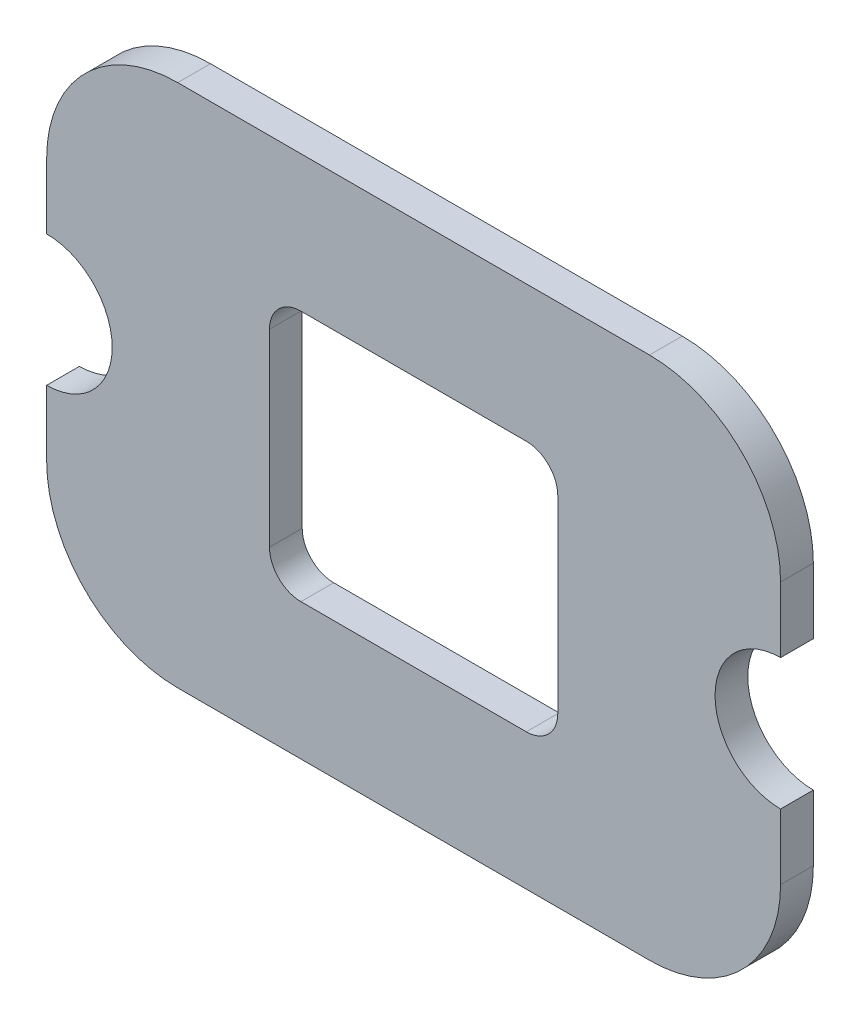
ISO-10303-21;
HEADER;
FILE_DESCRIPTION(('STEP AP214'),'2;1');
FILE_NAME('part.step','',(''),(''),'','','');
FILE_SCHEMA(('AUTOMOTIVE_DESIGN { 1 0 10303 214 1 1 1 1 }'));
ENDSEC;
DATA;
#1=APPLICATION_CONTEXT('core data for automotive mechanical design processes');
#2=APPLICATION_PROTOCOL_DEFINITION('international standard','automotive_design',2000,#1);
#3=PRODUCT_CONTEXT('',#1,'mechanical');
#4=PRODUCT('Part','Part','',(#3));
#5=PRODUCT_RELATED_PRODUCT_CATEGORY('part','',(#4));
#6=PRODUCT_DEFINITION_FORMATION('','',#4);
#7=PRODUCT_DEFINITION_CONTEXT('part definition',#1,'design');
#8=PRODUCT_DEFINITION('design','',#6,#7);
#9=PRODUCT_DEFINITION_SHAPE('','',#8);
#10=(LENGTH_UNIT() NAMED_UNIT(*) SI_UNIT(.MILLI.,.METRE.));
#11=(NAMED_UNIT(*) PLANE_ANGLE_UNIT() SI_UNIT($,.RADIAN.));
#12=(NAMED_UNIT(*) SI_UNIT($,.STERADIAN.) SOLID_ANGLE_UNIT());
#13=UNCERTAINTY_MEASURE_WITH_UNIT(LENGTH_MEASURE(1.E-05),#10,'distance_accuracy_value','');
#14=(GEOMETRIC_REPRESENTATION_CONTEXT(3) GLOBAL_UNCERTAINTY_ASSIGNED_CONTEXT((#13)) GLOBAL_UNIT_ASSIGNED_CONTEXT((#10,
#11,#12)) REPRESENTATION_CONTEXT('',''));
#15=CARTESIAN_POINT('',(0.,0.,0.));
#16=DIRECTION('',(0.,0.,1.));
#17=DIRECTION('',(1.,0.,0.));
#18=AXIS2_PLACEMENT_3D('',#15,#16,#17);
#19=CARTESIAN_POINT('',(-11.43,6.35,1.5875));
#20=DIRECTION('',(0.,0.,1.));
#21=DIRECTION('',(1.,0.,0.));
#22=AXIS2_PLACEMENT_3D('',#19,#20,#21);
#23=PLANE('',#22);
#24=CARTESIAN_POINT('',(-11.43,-6.35,1.5875));
#25=DIRECTION('',(0.,0.,-1.));
#26=DIRECTION('',(-1.,0.,0.));
#27=AXIS2_PLACEMENT_3D('',#24,#25,#26);
#28=CIRCLE('',#27,6.35);
#29=CARTESIAN_POINT('',(-11.43,-12.7,1.5875));
#30=VERTEX_POINT('',#29);
#31=CARTESIAN_POINT('',(-17.78,-6.35,1.5875));
#32=VERTEX_POINT('',#31);
#33=EDGE_CURVE('E266',#30,#32,#28,.T.);
#34=ORIENTED_EDGE('',*,*,#33,.F.);
#35=DIRECTION('',(1.,0.,0.));
#36=VECTOR('',#35,1.);
#37=CARTESIAN_POINT('',(-11.4299999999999,-12.7,1.5875));
#38=LINE('',#37,#36);
#39=CARTESIAN_POINT('',(11.43,-12.7,1.5875));
#40=VERTEX_POINT('',#39);
#41=EDGE_CURVE('E200',#30,#40,#38,.T.);
#42=ORIENTED_EDGE('',*,*,#41,.T.);
#43=CARTESIAN_POINT('',(11.43,-6.35,1.5875));
#44=DIRECTION('',(0.,0.,-1.));
#45=DIRECTION('',(-1.,0.,0.));
#46=AXIS2_PLACEMENT_3D('',#43,#44,#45);
#47=CIRCLE('',#46,6.35);
#48=CARTESIAN_POINT('',(17.78,-6.34999999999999,1.5875));
#49=VERTEX_POINT('',#48);
#50=EDGE_CURVE('E203',#49,#40,#47,.T.);
#51=ORIENTED_EDGE('',*,*,#50,.F.);
#52=DIRECTION('',(0.,-1.,0.));
#53=VECTOR('',#52,1.);
#54=CARTESIAN_POINT('',(17.78,6.34999999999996,1.5875));
#55=LINE('',#54,#53);
#56=CARTESIAN_POINT('',(17.78,-3.175,1.5875));
#57=VERTEX_POINT('',#56);
#58=EDGE_CURVE('E197',#49,#57,#55,.F.);
#59=ORIENTED_EDGE('',*,*,#58,.T.);
#60=CARTESIAN_POINT('',(17.78,0.,1.5875));
#61=DIRECTION('',(0.,0.,1.));
#62=DIRECTION('',(1.,0.,0.));
#63=AXIS2_PLACEMENT_3D('',#60,#61,#62);
#64=CIRCLE('',#63,3.175);
#65=CARTESIAN_POINT('',(17.78,3.175,1.5875));
#66=VERTEX_POINT('',#65);
#67=EDGE_CURVE('E164',#57,#66,#64,.F.);
#68=ORIENTED_EDGE('',*,*,#67,.T.);
#69=DIRECTION('',(0.,-1.,0.));
#70=VECTOR('',#69,1.);
#71=CARTESIAN_POINT('',(17.78,6.34999999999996,1.5875));
#72=LINE('',#71,#70);
#73=CARTESIAN_POINT('',(17.78,6.34999999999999,1.5875));
#74=VERTEX_POINT('',#73);
#75=EDGE_CURVE('E160',#66,#74,#72,.F.);
#76=ORIENTED_EDGE('',*,*,#75,.T.);
#77=CARTESIAN_POINT('',(11.43,6.35,1.5875));
#78=DIRECTION('',(0.,0.,-1.));
#79=DIRECTION('',(-1.,0.,0.));
#80=AXIS2_PLACEMENT_3D('',#77,#78,#79);
#81=CIRCLE('',#80,6.35);
#82=CARTESIAN_POINT('',(11.43,12.7,1.5875));
#83=VERTEX_POINT('',#82);
#84=EDGE_CURVE('E20',#83,#74,#81,.T.);
#85=ORIENTED_EDGE('',*,*,#84,.F.);
#86=DIRECTION('',(1.,0.,0.));
#87=VECTOR('',#86,1.);
#88=CARTESIAN_POINT('',(-11.43,12.7,1.5875));
#89=LINE('',#88,#87);
#90=CARTESIAN_POINT('',(-11.43,12.7,1.5875));
#91=VERTEX_POINT('',#90);
#92=EDGE_CURVE('E173',#83,#91,#89,.F.);
#93=ORIENTED_EDGE('',*,*,#92,.T.);
#94=CARTESIAN_POINT('',(-11.43,6.35,1.5875));
#95=DIRECTION('',(0.,0.,-1.));
#96=DIRECTION('',(-1.,0.,0.));
#97=AXIS2_PLACEMENT_3D('',#94,#95,#96);
#98=CIRCLE('',#97,6.35);
#99=CARTESIAN_POINT('',(-17.78,6.34999999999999,1.5875));
#100=VERTEX_POINT('',#99);
#101=EDGE_CURVE('E215',#100,#91,#98,.T.);
#102=ORIENTED_EDGE('',*,*,#101,.F.);
#103=DIRECTION('',(0.,1.,0.));
#104=VECTOR('',#103,1.);
#105=CARTESIAN_POINT('',(-17.78,6.34999999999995,1.5875));
#106=LINE('',#105,#104);
#107=CARTESIAN_POINT('',(-17.78,3.175,1.5875));
#108=VERTEX_POINT('',#107);
#109=EDGE_CURVE('E210',#100,#108,#106,.F.);
#110=ORIENTED_EDGE('',*,*,#109,.T.);
#111=CARTESIAN_POINT('',(-17.78,0.,1.5875));
#112=DIRECTION('',(0.,0.,1.));
#113=DIRECTION('',(1.,0.,0.));
#114=AXIS2_PLACEMENT_3D('',#111,#112,#113);
#115=CIRCLE('',#114,3.175);
#116=CARTESIAN_POINT('',(-17.78,-3.175,1.5875));
#117=VERTEX_POINT('',#116);
#118=EDGE_CURVE('E209',#108,#117,#115,.F.);
#119=ORIENTED_EDGE('',*,*,#118,.T.);
#120=DIRECTION('',(0.,1.,0.));
#121=VECTOR('',#120,1.);
#122=CARTESIAN_POINT('',(-17.78,6.34999999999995,1.5875));
#123=LINE('',#122,#121);
#124=EDGE_CURVE('E205',#117,#32,#123,.F.);
#125=ORIENTED_EDGE('',*,*,#124,.T.);
#126=EDGE_LOOP('',(#34,#42,#51,#59,#68,#76,#85,#93,#102,#110,#119,#125));
#127=FACE_BOUND('',#126,.T.);
#128=CARTESIAN_POINT('',(-5.461,4.572,1.5875));
#129=DIRECTION('',(0.,0.,1.));
#130=DIRECTION('',(1.,0.,0.));
#131=AXIS2_PLACEMENT_3D('',#128,#129,#130);
#132=CIRCLE('',#131,1.524);
#133=CARTESIAN_POINT('',(-6.985,4.572,1.5875));
#134=VERTEX_POINT('',#133);
#135=CARTESIAN_POINT('',(-5.461,6.096,1.5875));
#136=VERTEX_POINT('',#135);
#137=EDGE_CURVE('E257',#134,#136,#132,.F.);
#138=ORIENTED_EDGE('',*,*,#137,.T.);
#139=DIRECTION('',(1.,0.,0.));
#140=VECTOR('',#139,1.);
#141=CARTESIAN_POINT('',(-5.461,6.096,1.5875));
#142=LINE('',#141,#140);
#143=CARTESIAN_POINT('',(5.461,6.096,1.5875));
#144=VERTEX_POINT('',#143);
#145=EDGE_CURVE('E187',#136,#144,#142,.T.);
#146=ORIENTED_EDGE('',*,*,#145,.T.);
#147=CARTESIAN_POINT('',(5.461,4.572,1.5875));
#148=DIRECTION('',(0.,0.,1.));
#149=DIRECTION('',(1.,0.,0.));
#150=AXIS2_PLACEMENT_3D('',#147,#148,#149);
#151=CIRCLE('',#150,1.524);
#152=CARTESIAN_POINT('',(6.985,4.572,1.5875));
#153=VERTEX_POINT('',#152);
#154=EDGE_CURVE('E254',#144,#153,#151,.F.);
#155=ORIENTED_EDGE('',*,*,#154,.T.);
#156=DIRECTION('',(0.,1.,0.));
#157=VECTOR('',#156,1.);
#158=CARTESIAN_POINT('',(6.985,4.572,1.5875));
#159=LINE('',#158,#157);
#160=CARTESIAN_POINT('',(6.985,-4.572,1.5875));
#161=VERTEX_POINT('',#160);
#162=EDGE_CURVE('E177',#153,#161,#159,.F.);
#163=ORIENTED_EDGE('',*,*,#162,.T.);
#164=CARTESIAN_POINT('',(5.461,-4.572,1.5875));
#165=DIRECTION('',(0.,0.,1.));
#166=DIRECTION('',(1.,0.,0.));
#167=AXIS2_PLACEMENT_3D('',#164,#165,#166);
#168=CIRCLE('',#167,1.524);
#169=CARTESIAN_POINT('',(5.461,-6.096,1.5875));
#170=VERTEX_POINT('',#169);
#171=EDGE_CURVE('E250',#161,#170,#168,.F.);
#172=ORIENTED_EDGE('',*,*,#171,.T.);
#173=DIRECTION('',(1.,0.,0.));
#174=VECTOR('',#173,1.);
#175=CARTESIAN_POINT('',(-5.461,-6.096,1.5875));
#176=LINE('',#175,#174);
#177=CARTESIAN_POINT('',(-5.461,-6.096,1.5875));
#178=VERTEX_POINT('',#177);
#179=EDGE_CURVE('E182',#170,#178,#176,.F.);
#180=ORIENTED_EDGE('',*,*,#179,.T.);
#181=CARTESIAN_POINT('',(-5.461,-4.572,1.5875));
#182=DIRECTION('',(0.,0.,1.));
#183=DIRECTION('',(1.,0.,0.));
#184=AXIS2_PLACEMENT_3D('',#181,#182,#183);
#185=CIRCLE('',#184,1.524);
#186=CARTESIAN_POINT('',(-6.985,-4.572,1.5875));
#187=VERTEX_POINT('',#186);
#188=EDGE_CURVE('E185',#178,#187,#185,.F.);
#189=ORIENTED_EDGE('',*,*,#188,.T.);
#190=DIRECTION('',(0.,-1.,0.));
#191=VECTOR('',#190,1.);
#192=CARTESIAN_POINT('',(-6.985,4.572,1.5875));
#193=LINE('',#192,#191);
#194=EDGE_CURVE('E192',#187,#134,#193,.F.);
#195=ORIENTED_EDGE('',*,*,#194,.T.);
#196=EDGE_LOOP('',(#138,#146,#155,#163,#172,#180,#189,#195));
#197=FACE_BOUND('',#196,.T.);
#198=ADVANCED_FACE('F17',(#127,#197),#23,.T.);
#199=CARTESIAN_POINT('',(17.78,6.34999999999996,1.5875));
#200=DIRECTION('',(-1.,0.,0.));
#201=DIRECTION('',(0.,-1.,0.));
#202=AXIS2_PLACEMENT_3D('',#199,#200,#201);
#203=PLANE('',#202);
#204=DIRECTION('',(0.,1.,0.));
#205=VECTOR('',#204,1.);
#206=CARTESIAN_POINT('',(17.78,6.35,0.));
#207=LINE('',#206,#205);
#208=CARTESIAN_POINT('',(17.78,3.175,0.));
#209=VERTEX_POINT('',#208);
#210=CARTESIAN_POINT('',(17.78,6.34999999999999,0.));
#211=VERTEX_POINT('',#210);
#212=EDGE_CURVE('E171',#209,#211,#207,.T.);
#213=ORIENTED_EDGE('',*,*,#212,.T.);
#214=DIRECTION('',(0.,0.,-1.));
#215=VECTOR('',#214,1.);
#216=CARTESIAN_POINT('',(17.78,6.34999999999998,1.5875));
#217=LINE('',#216,#215);
#218=EDGE_CURVE('E157',#74,#211,#217,.T.);
#219=ORIENTED_EDGE('',*,*,#218,.F.);
#220=ORIENTED_EDGE('',*,*,#75,.F.);
#221=DIRECTION('',(0.,0.,1.));
#222=VECTOR('',#221,1.);
#223=CARTESIAN_POINT('',(17.78,3.175,0.));
#224=LINE('',#223,#222);
#225=EDGE_CURVE('E263',#66,#209,#224,.F.);
#226=ORIENTED_EDGE('',*,*,#225,.T.);
#227=EDGE_LOOP('',(#213,#219,#220,#226));
#228=FACE_BOUND('',#227,.T.);
#229=ADVANCED_FACE('F170',(#228),#203,.F.);
#230=CARTESIAN_POINT('',(11.43,6.35,1.5875));
#231=DIRECTION('',(0.,0.,-1.));
#232=DIRECTION('',(-1.,0.,0.));
#233=AXIS2_PLACEMENT_3D('',#230,#231,#232);
#234=CYLINDRICAL_SURFACE('',#233,6.35);
#235=CARTESIAN_POINT('',(11.43,6.35,0.));
#236=DIRECTION('',(0.,0.,-1.));
#237=DIRECTION('',(-1.,0.,0.));
#238=AXIS2_PLACEMENT_3D('',#235,#236,#237);
#239=CIRCLE('',#238,6.35);
#240=CARTESIAN_POINT('',(11.43,12.7,0.));
#241=VERTEX_POINT('',#240);
#242=EDGE_CURVE('E248',#211,#241,#239,.F.);
#243=ORIENTED_EDGE('',*,*,#242,.T.);
#244=DIRECTION('',(0.,0.,-1.));
#245=VECTOR('',#244,1.);
#246=CARTESIAN_POINT('',(11.43,12.7,1.5875));
#247=LINE('',#246,#245);
#248=EDGE_CURVE('E159',#241,#83,#247,.F.);
#249=ORIENTED_EDGE('',*,*,#248,.T.);
#250=ORIENTED_EDGE('',*,*,#84,.T.);
#251=ORIENTED_EDGE('',*,*,#218,.T.);
#252=EDGE_LOOP('',(#243,#249,#250,#251));
#253=FACE_BOUND('',#252,.T.);
#254=ADVANCED_FACE('F155',(#253),#234,.T.);
#255=CARTESIAN_POINT('',(-11.43,12.7,1.5875));
#256=DIRECTION('',(0.,-1.,0.));
#257=DIRECTION('',(0.,0.,-1.));
#258=AXIS2_PLACEMENT_3D('',#255,#256,#257);
#259=PLANE('',#258);
#260=ORIENTED_EDGE('',*,*,#92,.F.);
#261=ORIENTED_EDGE('',*,*,#248,.F.);
#262=DIRECTION('',(1.,0.,0.));
#263=VECTOR('',#262,1.);
#264=CARTESIAN_POINT('',(-11.43,12.7,0.));
#265=LINE('',#264,#263);
#266=CARTESIAN_POINT('',(-11.43,12.7,0.));
#267=VERTEX_POINT('',#266);
#268=EDGE_CURVE('E247',#241,#267,#265,.F.);
#269=ORIENTED_EDGE('',*,*,#268,.T.);
#270=DIRECTION('',(0.,0.,-1.));
#271=VECTOR('',#270,1.);
#272=CARTESIAN_POINT('',(-11.43,12.7,1.5875));
#273=LINE('',#272,#271);
#274=EDGE_CURVE('E270',#91,#267,#273,.T.);
#275=ORIENTED_EDGE('',*,*,#274,.F.);
#276=EDGE_LOOP('',(#260,#261,#269,#275));
#277=FACE_BOUND('',#276,.T.);
#278=ADVANCED_FACE('F405',(#277),#259,.F.);
#279=CARTESIAN_POINT('',(-11.43,6.35,1.5875));
#280=DIRECTION('',(0.,0.,-1.));
#281=DIRECTION('',(-1.,0.,0.));
#282=AXIS2_PLACEMENT_3D('',#279,#280,#281);
#283=CYLINDRICAL_SURFACE('',#282,6.35);
#284=CARTESIAN_POINT('',(-11.43,6.35,0.));
#285=DIRECTION('',(0.,0.,-1.));
#286=DIRECTION('',(-1.,0.,0.));
#287=AXIS2_PLACEMENT_3D('',#284,#285,#286);
#288=CIRCLE('',#287,6.35);
#289=CARTESIAN_POINT('',(-17.78,6.34999999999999,0.));
#290=VERTEX_POINT('',#289);
#291=EDGE_CURVE('E244',#267,#290,#288,.F.);
#292=ORIENTED_EDGE('',*,*,#291,.T.);
#293=DIRECTION('',(0.,0.,1.));
#294=VECTOR('',#293,1.);
#295=CARTESIAN_POINT('',(-17.78,6.34999999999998,1.5875));
#296=LINE('',#295,#294);
#297=EDGE_CURVE('E214',#290,#100,#296,.T.);
#298=ORIENTED_EDGE('',*,*,#297,.T.);
#299=ORIENTED_EDGE('',*,*,#101,.T.);
#300=ORIENTED_EDGE('',*,*,#274,.T.);
#301=EDGE_LOOP('',(#292,#298,#299,#300));
#302=FACE_BOUND('',#301,.T.);
#303=ADVANCED_FACE('F401',(#302),#283,.T.);
#304=CARTESIAN_POINT('',(-17.78,6.34999999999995,1.5875));
#305=DIRECTION('',(1.,0.,0.));
#306=DIRECTION('',(0.,1.,0.));
#307=AXIS2_PLACEMENT_3D('',#304,#305,#306);
#308=PLANE('',#307);
#309=ORIENTED_EDGE('',*,*,#109,.F.);
#310=ORIENTED_EDGE('',*,*,#297,.F.);
#311=DIRECTION('',(0.,1.,0.));
#312=VECTOR('',#311,1.);
#313=CARTESIAN_POINT('',(-17.78,6.35,0.));
#314=LINE('',#313,#312);
#315=CARTESIAN_POINT('',(-17.78,3.175,0.));
#316=VERTEX_POINT('',#315);
#317=EDGE_CURVE('E243',#290,#316,#314,.F.);
#318=ORIENTED_EDGE('',*,*,#317,.T.);
#319=DIRECTION('',(0.,0.,1.));
#320=VECTOR('',#319,1.);
#321=CARTESIAN_POINT('',(-17.78,3.175,0.));
#322=LINE('',#321,#320);
#323=EDGE_CURVE('E213',#316,#108,#322,.T.);
#324=ORIENTED_EDGE('',*,*,#323,.T.);
#325=EDGE_LOOP('',(#309,#310,#318,#324));
#326=FACE_BOUND('',#325,.T.);
#327=ADVANCED_FACE('F397',(#326),#308,.F.);
#328=CARTESIAN_POINT('',(-17.78,0.,0.));
#329=DIRECTION('',(0.,0.,1.));
#330=DIRECTION('',(1.,0.,0.));
#331=AXIS2_PLACEMENT_3D('',#328,#329,#330);
#332=CYLINDRICAL_SURFACE('',#331,3.175);
#333=CARTESIAN_POINT('',(-17.78,0.,0.));
#334=DIRECTION('',(0.,0.,1.));
#335=DIRECTION('',(1.,0.,0.));
#336=AXIS2_PLACEMENT_3D('',#333,#334,#335);
#337=CIRCLE('',#336,3.175);
#338=CARTESIAN_POINT('',(-17.78,-3.175,0.));
#339=VERTEX_POINT('',#338);
#340=EDGE_CURVE('E241',#316,#339,#337,.F.);
#341=ORIENTED_EDGE('',*,*,#340,.T.);
#342=DIRECTION('',(0.,0.,1.));
#343=VECTOR('',#342,1.);
#344=CARTESIAN_POINT('',(-17.78,-3.175,1.5875));
#345=LINE('',#344,#343);
#346=EDGE_CURVE('E208',#339,#117,#345,.T.);
#347=ORIENTED_EDGE('',*,*,#346,.T.);
#348=ORIENTED_EDGE('',*,*,#118,.F.);
#349=ORIENTED_EDGE('',*,*,#323,.F.);
#350=EDGE_LOOP('',(#341,#347,#348,#349));
#351=FACE_BOUND('',#350,.T.);
#352=ADVANCED_FACE('F393',(#351),#332,.F.);
#353=CARTESIAN_POINT('',(-17.78,6.34999999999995,1.5875));
#354=DIRECTION('',(1.,0.,0.));
#355=DIRECTION('',(0.,1.,0.));
#356=AXIS2_PLACEMENT_3D('',#353,#354,#355);
#357=PLANE('',#356);
#358=DIRECTION('',(0.,1.,0.));
#359=VECTOR('',#358,1.);
#360=CARTESIAN_POINT('',(-17.78,6.35,0.));
#361=LINE('',#360,#359);
#362=CARTESIAN_POINT('',(-17.78,-6.35,0.));
#363=VERTEX_POINT('',#362);
#364=EDGE_CURVE('E240',#339,#363,#361,.F.);
#365=ORIENTED_EDGE('',*,*,#364,.T.);
#366=DIRECTION('',(0.,0.,-1.));
#367=VECTOR('',#366,1.);
#368=CARTESIAN_POINT('',(-17.78,-6.35,1.5875));
#369=LINE('',#368,#367);
#370=EDGE_CURVE('E268',#32,#363,#369,.T.);
#371=ORIENTED_EDGE('',*,*,#370,.F.);
#372=ORIENTED_EDGE('',*,*,#124,.F.);
#373=ORIENTED_EDGE('',*,*,#346,.F.);
#374=EDGE_LOOP('',(#365,#371,#372,#373));
#375=FACE_BOUND('',#374,.T.);
#376=ADVANCED_FACE('F389',(#375),#357,.F.);
#377=CARTESIAN_POINT('',(-11.43,-6.35,1.5875));
#378=DIRECTION('',(0.,0.,-1.));
#379=DIRECTION('',(-1.,0.,0.));
#380=AXIS2_PLACEMENT_3D('',#377,#378,#379);
#381=CYLINDRICAL_SURFACE('',#380,6.35);
#382=CARTESIAN_POINT('',(-11.43,-6.35,0.));
#383=DIRECTION('',(0.,0.,-1.));
#384=DIRECTION('',(-1.,0.,0.));
#385=AXIS2_PLACEMENT_3D('',#382,#383,#384);
#386=CIRCLE('',#385,6.35);
#387=CARTESIAN_POINT('',(-11.43,-12.7,0.));
#388=VERTEX_POINT('',#387);
#389=EDGE_CURVE('E237',#363,#388,#386,.F.);
#390=ORIENTED_EDGE('',*,*,#389,.T.);
#391=DIRECTION('',(0.,0.,1.));
#392=VECTOR('',#391,1.);
#393=CARTESIAN_POINT('',(-11.43,-12.7,1.5875));
#394=LINE('',#393,#392);
#395=EDGE_CURVE('E204',#388,#30,#394,.T.);
#396=ORIENTED_EDGE('',*,*,#395,.T.);
#397=ORIENTED_EDGE('',*,*,#33,.T.);
#398=ORIENTED_EDGE('',*,*,#370,.T.);
#399=EDGE_LOOP('',(#390,#396,#397,#398));
#400=FACE_BOUND('',#399,.T.);
#401=ADVANCED_FACE('F385',(#400),#381,.T.);
#402=CARTESIAN_POINT('',(-11.4299999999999,-12.7,1.5875));
#403=DIRECTION('',(0.,1.,0.));
#404=DIRECTION('',(0.,0.,1.));
#405=AXIS2_PLACEMENT_3D('',#402,#403,#404);
#406=PLANE('',#405);
#407=ORIENTED_EDGE('',*,*,#41,.F.);
#408=ORIENTED_EDGE('',*,*,#395,.F.);
#409=DIRECTION('',(1.,0.,0.));
#410=VECTOR('',#409,1.);
#411=CARTESIAN_POINT('',(-11.43,-12.7,0.));
#412=LINE('',#411,#410);
#413=CARTESIAN_POINT('',(11.43,-12.7,0.));
#414=VERTEX_POINT('',#413);
#415=EDGE_CURVE('E236',#388,#414,#412,.T.);
#416=ORIENTED_EDGE('',*,*,#415,.T.);
#417=DIRECTION('',(0.,0.,-1.));
#418=VECTOR('',#417,1.);
#419=CARTESIAN_POINT('',(11.43,-12.7,1.5875));
#420=LINE('',#419,#418);
#421=EDGE_CURVE('E265',#40,#414,#420,.T.);
#422=ORIENTED_EDGE('',*,*,#421,.F.);
#423=EDGE_LOOP('',(#407,#408,#416,#422));
#424=FACE_BOUND('',#423,.T.);
#425=ADVANCED_FACE('F381',(#424),#406,.F.);
#426=CARTESIAN_POINT('',(11.43,-6.35,1.5875));
#427=DIRECTION('',(0.,0.,-1.));
#428=DIRECTION('',(-1.,0.,0.));
#429=AXIS2_PLACEMENT_3D('',#426,#427,#428);
#430=CYLINDRICAL_SURFACE('',#429,6.35);
#431=CARTESIAN_POINT('',(11.43,-6.35,0.));
#432=DIRECTION('',(0.,0.,-1.));
#433=DIRECTION('',(-1.,0.,0.));
#434=AXIS2_PLACEMENT_3D('',#431,#432,#433);
#435=CIRCLE('',#434,6.35);
#436=CARTESIAN_POINT('',(17.78,-6.34999999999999,0.));
#437=VERTEX_POINT('',#436);
#438=EDGE_CURVE('E233',#414,#437,#435,.F.);
#439=ORIENTED_EDGE('',*,*,#438,.T.);
#440=DIRECTION('',(0.,0.,1.));
#441=VECTOR('',#440,1.);
#442=CARTESIAN_POINT('',(17.78,-6.34999999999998,1.5875));
#443=LINE('',#442,#441);
#444=EDGE_CURVE('E198',#437,#49,#443,.T.);
#445=ORIENTED_EDGE('',*,*,#444,.T.);
#446=ORIENTED_EDGE('',*,*,#50,.T.);
#447=ORIENTED_EDGE('',*,*,#421,.T.);
#448=EDGE_LOOP('',(#439,#445,#446,#447));
#449=FACE_BOUND('',#448,.T.);
#450=ADVANCED_FACE('F377',(#449),#430,.T.);
#451=CARTESIAN_POINT('',(17.78,6.34999999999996,1.5875));
#452=DIRECTION('',(-1.,0.,0.));
#453=DIRECTION('',(0.,-1.,0.));
#454=AXIS2_PLACEMENT_3D('',#451,#452,#453);
#455=PLANE('',#454);
#456=ORIENTED_EDGE('',*,*,#58,.F.);
#457=ORIENTED_EDGE('',*,*,#444,.F.);
#458=DIRECTION('',(0.,1.,0.));
#459=VECTOR('',#458,1.);
#460=CARTESIAN_POINT('',(17.78,6.35,0.));
#461=LINE('',#460,#459);
#462=CARTESIAN_POINT('',(17.78,-3.175,0.));
#463=VERTEX_POINT('',#462);
#464=EDGE_CURVE('E232',#437,#463,#461,.T.);
#465=ORIENTED_EDGE('',*,*,#464,.T.);
#466=DIRECTION('',(0.,0.,1.));
#467=VECTOR('',#466,1.);
#468=CARTESIAN_POINT('',(17.78,-3.175,0.));
#469=LINE('',#468,#467);
#470=EDGE_CURVE('E186',#463,#57,#469,.T.);
#471=ORIENTED_EDGE('',*,*,#470,.T.);
#472=EDGE_LOOP('',(#456,#457,#465,#471));
#473=FACE_BOUND('',#472,.T.);
#474=ADVANCED_FACE('F373',(#473),#455,.F.);
#475=CARTESIAN_POINT('',(17.78,0.,0.));
#476=DIRECTION('',(0.,0.,1.));
#477=DIRECTION('',(1.,0.,0.));
#478=AXIS2_PLACEMENT_3D('',#475,#476,#477);
#479=CYLINDRICAL_SURFACE('',#478,3.175);
#480=CARTESIAN_POINT('',(17.78,0.,0.));
#481=DIRECTION('',(0.,0.,1.));
#482=DIRECTION('',(1.,0.,0.));
#483=AXIS2_PLACEMENT_3D('',#480,#481,#482);
#484=CIRCLE('',#483,3.175);
#485=EDGE_CURVE('E229',#463,#209,#484,.F.);
#486=ORIENTED_EDGE('',*,*,#485,.T.);
#487=ORIENTED_EDGE('',*,*,#225,.F.);
#488=ORIENTED_EDGE('',*,*,#67,.F.);
#489=ORIENTED_EDGE('',*,*,#470,.F.);
#490=EDGE_LOOP('',(#486,#487,#488,#489));
#491=FACE_BOUND('',#490,.T.);
#492=ADVANCED_FACE('F370',(#491),#479,.F.);
#493=CARTESIAN_POINT('',(-5.461,-6.096,0.));
#494=DIRECTION('',(0.,-1.,0.));
#495=DIRECTION('',(1.,0.,0.));
#496=AXIS2_PLACEMENT_3D('',#493,#494,#495);
#497=PLANE('',#496);
#498=DIRECTION('',(1.,0.,0.));
#499=VECTOR('',#498,1.);
#500=CARTESIAN_POINT('',(-11.43,-6.096,0.));
#501=LINE('',#500,#499);
#502=CARTESIAN_POINT('',(5.461,-6.096,0.));
#503=VERTEX_POINT('',#502);
#504=CARTESIAN_POINT('',(-5.461,-6.096,0.));
#505=VERTEX_POINT('',#504);
#506=EDGE_CURVE('E228',#503,#505,#501,.F.);
#507=ORIENTED_EDGE('',*,*,#506,.T.);
#508=DIRECTION('',(0.,0.,1.));
#509=VECTOR('',#508,1.);
#510=CARTESIAN_POINT('',(-5.461,-6.096,0.));
#511=LINE('',#510,#509);
#512=EDGE_CURVE('E196',#505,#178,#511,.T.);
#513=ORIENTED_EDGE('',*,*,#512,.T.);
#514=ORIENTED_EDGE('',*,*,#179,.F.);
#515=DIRECTION('',(0.,0.,1.));
#516=VECTOR('',#515,1.);
#517=CARTESIAN_POINT('',(5.461,-6.096,0.));
#518=LINE('',#517,#516);
#519=EDGE_CURVE('E253',#170,#503,#518,.F.);
#520=ORIENTED_EDGE('',*,*,#519,.T.);
#521=EDGE_LOOP('',(#507,#513,#514,#520));
#522=FACE_BOUND('',#521,.T.);
#523=ADVANCED_FACE('F345',(#522),#497,.F.);
#524=CARTESIAN_POINT('',(-5.461,-4.572,0.));
#525=DIRECTION('',(0.,0.,1.));
#526=DIRECTION('',(1.,0.,0.));
#527=AXIS2_PLACEMENT_3D('',#524,#525,#526);
#528=CYLINDRICAL_SURFACE('',#527,1.524);
#529=CARTESIAN_POINT('',(-5.461,-4.572,0.));
#530=DIRECTION('',(0.,0.,1.));
#531=DIRECTION('',(1.,0.,0.));
#532=AXIS2_PLACEMENT_3D('',#529,#530,#531);
#533=CIRCLE('',#532,1.524);
#534=CARTESIAN_POINT('',(-6.985,-4.572,0.));
#535=VERTEX_POINT('',#534);
#536=EDGE_CURVE('E225',#505,#535,#533,.F.);
#537=ORIENTED_EDGE('',*,*,#536,.T.);
#538=DIRECTION('',(0.,0.,1.));
#539=VECTOR('',#538,1.);
#540=CARTESIAN_POINT('',(-6.985,-4.572,0.));
#541=LINE('',#540,#539);
#542=EDGE_CURVE('E195',#535,#187,#541,.T.);
#543=ORIENTED_EDGE('',*,*,#542,.T.);
#544=ORIENTED_EDGE('',*,*,#188,.F.);
#545=ORIENTED_EDGE('',*,*,#512,.F.);
#546=EDGE_LOOP('',(#537,#543,#544,#545));
#547=FACE_BOUND('',#546,.T.);
#548=ADVANCED_FACE('F343',(#547),#528,.F.);
#549=CARTESIAN_POINT('',(-6.985,4.572,0.));
#550=DIRECTION('',(-1.,0.,0.));
#551=DIRECTION('',(0.,-1.,0.));
#552=AXIS2_PLACEMENT_3D('',#549,#550,#551);
#553=PLANE('',#552);
#554=DIRECTION('',(0.,1.,0.));
#555=VECTOR('',#554,1.);
#556=CARTESIAN_POINT('',(-6.985,6.35,0.));
#557=LINE('',#556,#555);
#558=CARTESIAN_POINT('',(-6.985,4.572,0.));
#559=VERTEX_POINT('',#558);
#560=EDGE_CURVE('E224',#535,#559,#557,.T.);
#561=ORIENTED_EDGE('',*,*,#560,.T.);
#562=DIRECTION('',(0.,0.,1.));
#563=VECTOR('',#562,1.);
#564=CARTESIAN_POINT('',(-6.985,4.572,0.));
#565=LINE('',#564,#563);
#566=EDGE_CURVE('E191',#559,#134,#565,.T.);
#567=ORIENTED_EDGE('',*,*,#566,.T.);
#568=ORIENTED_EDGE('',*,*,#194,.F.);
#569=ORIENTED_EDGE('',*,*,#542,.F.);
#570=EDGE_LOOP('',(#561,#567,#568,#569));
#571=FACE_BOUND('',#570,.T.);
#572=ADVANCED_FACE('F340',(#571),#553,.F.);
#573=CARTESIAN_POINT('',(-5.461,4.572,0.));
#574=DIRECTION('',(0.,0.,1.));
#575=DIRECTION('',(1.,0.,0.));
#576=AXIS2_PLACEMENT_3D('',#573,#574,#575);
#577=CYLINDRICAL_SURFACE('',#576,1.524);
#578=CARTESIAN_POINT('',(-5.461,4.572,0.));
#579=DIRECTION('',(0.,0.,1.));
#580=DIRECTION('',(1.,0.,0.));
#581=AXIS2_PLACEMENT_3D('',#578,#579,#580);
#582=CIRCLE('',#581,1.524);
#583=CARTESIAN_POINT('',(-5.461,6.096,0.));
#584=VERTEX_POINT('',#583);
#585=EDGE_CURVE('E221',#559,#584,#582,.F.);
#586=ORIENTED_EDGE('',*,*,#585,.T.);
#587=DIRECTION('',(0.,0.,1.));
#588=VECTOR('',#587,1.);
#589=CARTESIAN_POINT('',(-5.461,6.096,0.));
#590=LINE('',#589,#588);
#591=EDGE_CURVE('E190',#584,#136,#590,.T.);
#592=ORIENTED_EDGE('',*,*,#591,.T.);
#593=ORIENTED_EDGE('',*,*,#137,.F.);
#594=ORIENTED_EDGE('',*,*,#566,.F.);
#595=EDGE_LOOP('',(#586,#592,#593,#594));
#596=FACE_BOUND('',#595,.T.);
#597=ADVANCED_FACE('F338',(#596),#577,.F.);
#598=CARTESIAN_POINT('',(-5.461,6.096,0.));
#599=DIRECTION('',(0.,1.,0.));
#600=DIRECTION('',(0.,0.,1.));
#601=AXIS2_PLACEMENT_3D('',#598,#599,#600);
#602=PLANE('',#601);
#603=DIRECTION('',(1.,0.,0.));
#604=VECTOR('',#603,1.);
#605=CARTESIAN_POINT('',(-11.43,6.096,0.));
#606=LINE('',#605,#604);
#607=CARTESIAN_POINT('',(5.461,6.096,0.));
#608=VERTEX_POINT('',#607);
#609=EDGE_CURVE('E220',#584,#608,#606,.T.);
#610=ORIENTED_EDGE('',*,*,#609,.T.);
#611=DIRECTION('',(0.,0.,1.));
#612=VECTOR('',#611,1.);
#613=CARTESIAN_POINT('',(5.461,6.096,0.));
#614=LINE('',#613,#612);
#615=EDGE_CURVE('E181',#608,#144,#614,.T.);
#616=ORIENTED_EDGE('',*,*,#615,.T.);
#617=ORIENTED_EDGE('',*,*,#145,.F.);
#618=ORIENTED_EDGE('',*,*,#591,.F.);
#619=EDGE_LOOP('',(#610,#616,#617,#618));
#620=FACE_BOUND('',#619,.T.);
#621=ADVANCED_FACE('F334',(#620),#602,.F.);
#622=CARTESIAN_POINT('',(5.461,4.572,0.));
#623=DIRECTION('',(0.,0.,1.));
#624=DIRECTION('',(1.,0.,0.));
#625=AXIS2_PLACEMENT_3D('',#622,#623,#624);
#626=CYLINDRICAL_SURFACE('',#625,1.524);
#627=CARTESIAN_POINT('',(5.461,4.572,0.));
#628=DIRECTION('',(0.,0.,1.));
#629=DIRECTION('',(1.,0.,0.));
#630=AXIS2_PLACEMENT_3D('',#627,#628,#629);
#631=CIRCLE('',#630,1.524);
#632=CARTESIAN_POINT('',(6.985,4.572,0.));
#633=VERTEX_POINT('',#632);
#634=EDGE_CURVE('E217',#608,#633,#631,.F.);
#635=ORIENTED_EDGE('',*,*,#634,.T.);
#636=DIRECTION('',(0.,0.,1.));
#637=VECTOR('',#636,1.);
#638=CARTESIAN_POINT('',(6.985,4.572,0.));
#639=LINE('',#638,#637);
#640=EDGE_CURVE('E180',#633,#153,#639,.T.);
#641=ORIENTED_EDGE('',*,*,#640,.T.);
#642=ORIENTED_EDGE('',*,*,#154,.F.);
#643=ORIENTED_EDGE('',*,*,#615,.F.);
#644=EDGE_LOOP('',(#635,#641,#642,#643));
#645=FACE_BOUND('',#644,.T.);
#646=ADVANCED_FACE('F332',(#645),#626,.F.);
#647=CARTESIAN_POINT('',(6.985,4.572,0.));
#648=DIRECTION('',(1.,0.,0.));
#649=DIRECTION('',(0.,1.,0.));
#650=AXIS2_PLACEMENT_3D('',#647,#648,#649);
#651=PLANE('',#650);
#652=DIRECTION('',(0.,1.,0.));
#653=VECTOR('',#652,1.);
#654=CARTESIAN_POINT('',(6.985,6.35,0.));
#655=LINE('',#654,#653);
#656=CARTESIAN_POINT('',(6.985,-4.572,0.));
#657=VERTEX_POINT('',#656);
#658=EDGE_CURVE('E26',#633,#657,#655,.F.);
#659=ORIENTED_EDGE('',*,*,#658,.T.);
#660=DIRECTION('',(0.,0.,1.));
#661=VECTOR('',#660,1.);
#662=CARTESIAN_POINT('',(6.985,-4.572,0.));
#663=LINE('',#662,#661);
#664=EDGE_CURVE('E34',#657,#161,#663,.T.);
#665=ORIENTED_EDGE('',*,*,#664,.T.);
#666=ORIENTED_EDGE('',*,*,#162,.F.);
#667=ORIENTED_EDGE('',*,*,#640,.F.);
#668=EDGE_LOOP('',(#659,#665,#666,#667));
#669=FACE_BOUND('',#668,.T.);
#670=ADVANCED_FACE('F325',(#669),#651,.F.);
#671=CARTESIAN_POINT('',(5.461,-4.572,0.));
#672=DIRECTION('',(0.,0.,1.));
#673=DIRECTION('',(1.,0.,0.));
#674=AXIS2_PLACEMENT_3D('',#671,#672,#673);
#675=CYLINDRICAL_SURFACE('',#674,1.524);
#676=CARTESIAN_POINT('',(5.461,-4.572,0.));
#677=DIRECTION('',(0.,0.,1.));
#678=DIRECTION('',(1.,0.,0.));
#679=AXIS2_PLACEMENT_3D('',#676,#677,#678);
#680=CIRCLE('',#679,1.524);
#681=EDGE_CURVE('E11',#657,#503,#680,.F.);
#682=ORIENTED_EDGE('',*,*,#681,.T.);
#683=ORIENTED_EDGE('',*,*,#519,.F.);
#684=ORIENTED_EDGE('',*,*,#171,.F.);
#685=ORIENTED_EDGE('',*,*,#664,.F.);
#686=EDGE_LOOP('',(#682,#683,#684,#685));
#687=FACE_BOUND('',#686,.T.);
#688=ADVANCED_FACE('F347',(#687),#675,.F.);
#689=CARTESIAN_POINT('',(-11.43,6.35,0.));
#690=DIRECTION('',(0.,0.,1.));
#691=DIRECTION('',(1.,0.,0.));
#692=AXIS2_PLACEMENT_3D('',#689,#690,#691);
#693=PLANE('',#692);
#694=ORIENTED_EDGE('',*,*,#658,.F.);
#695=ORIENTED_EDGE('',*,*,#634,.F.);
#696=ORIENTED_EDGE('',*,*,#609,.F.);
#697=ORIENTED_EDGE('',*,*,#585,.F.);
#698=ORIENTED_EDGE('',*,*,#560,.F.);
#699=ORIENTED_EDGE('',*,*,#536,.F.);
#700=ORIENTED_EDGE('',*,*,#506,.F.);
#701=ORIENTED_EDGE('',*,*,#681,.F.);
#702=EDGE_LOOP('',(#694,#695,#696,#697,#698,#699,#700,#701));
#703=FACE_BOUND('',#702,.T.);
#704=ORIENTED_EDGE('',*,*,#464,.F.);
#705=ORIENTED_EDGE('',*,*,#438,.F.);
#706=ORIENTED_EDGE('',*,*,#415,.F.);
#707=ORIENTED_EDGE('',*,*,#389,.F.);
#708=ORIENTED_EDGE('',*,*,#364,.F.);
#709=ORIENTED_EDGE('',*,*,#340,.F.);
#710=ORIENTED_EDGE('',*,*,#317,.F.);
#711=ORIENTED_EDGE('',*,*,#291,.F.);
#712=ORIENTED_EDGE('',*,*,#268,.F.);
#713=ORIENTED_EDGE('',*,*,#242,.F.);
#714=ORIENTED_EDGE('',*,*,#212,.F.);
#715=ORIENTED_EDGE('',*,*,#485,.F.);
#716=EDGE_LOOP('',(#704,#705,#706,#707,#708,#709,#710,#711,#712,#713,#714,#715));
#717=FACE_BOUND('',#716,.T.);
#718=ADVANCED_FACE('F328',(#703,#717),#693,.F.);
#719=CLOSED_SHELL('',(#198,#229,#254,#278,#303,#327,#352,#376,#401,#425,#450,#474,#492,#523,
#548,#572,#597,#621,#646,#670,#688,#718));
#720=MANIFOLD_SOLID_BREP('B1',#719);
#721=ADVANCED_BREP_SHAPE_REPRESENTATION('',(#18,#720),#14);
#722=SHAPE_DEFINITION_REPRESENTATION(#9,#721);
ENDSEC;
END-ISO-10303-21;
